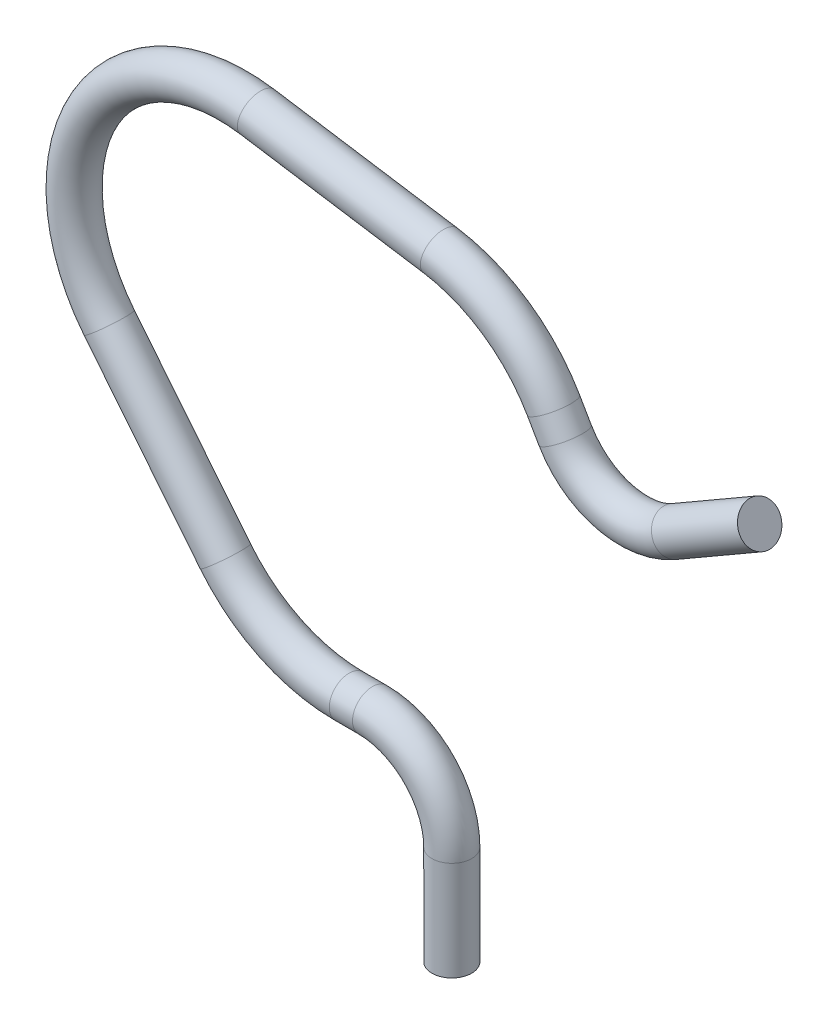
ISO-10303-21;
HEADER;
FILE_DESCRIPTION(('STEP AP214'),'2;1');
FILE_NAME('part.step','',(''),(''),'','','');
FILE_SCHEMA(('AUTOMOTIVE_DESIGN { 1 0 10303 214 1 1 1 1 }'));
ENDSEC;
DATA;
#1=APPLICATION_CONTEXT('core data for automotive mechanical design processes');
#2=APPLICATION_PROTOCOL_DEFINITION('international standard','automotive_design',2000,#1);
#3=PRODUCT_CONTEXT('',#1,'mechanical');
#4=PRODUCT('Part','Part','',(#3));
#5=PRODUCT_RELATED_PRODUCT_CATEGORY('part','',(#4));
#6=PRODUCT_DEFINITION_FORMATION('','',#4);
#7=PRODUCT_DEFINITION_CONTEXT('part definition',#1,'design');
#8=PRODUCT_DEFINITION('design','',#6,#7);
#9=PRODUCT_DEFINITION_SHAPE('','',#8);
#10=(LENGTH_UNIT() NAMED_UNIT(*) SI_UNIT(.MILLI.,.METRE.));
#11=(NAMED_UNIT(*) PLANE_ANGLE_UNIT() SI_UNIT($,.RADIAN.));
#12=(NAMED_UNIT(*) SI_UNIT($,.STERADIAN.) SOLID_ANGLE_UNIT());
#13=UNCERTAINTY_MEASURE_WITH_UNIT(LENGTH_MEASURE(1.E-05),#10,'distance_accuracy_value','');
#14=(GEOMETRIC_REPRESENTATION_CONTEXT(3) GLOBAL_UNCERTAINTY_ASSIGNED_CONTEXT((#13)) GLOBAL_UNIT_ASSIGNED_CONTEXT((#10,
#11,#12)) REPRESENTATION_CONTEXT('',''));
#15=CARTESIAN_POINT('',(0.,0.,0.));
#16=DIRECTION('',(0.,0.,1.));
#17=DIRECTION('',(1.,0.,0.));
#18=AXIS2_PLACEMENT_3D('',#15,#16,#17);
#19=CARTESIAN_POINT('',(5.58493649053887,12.1733937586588,0.));
#20=DIRECTION('',(0.866025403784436,0.500000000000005,0.));
#21=DIRECTION('',(-0.500000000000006,0.866025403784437,0.));
#22=AXIS2_PLACEMENT_3D('',#19,#20,#21);
#23=CYLINDRICAL_SURFACE('',#22,0.5);
#24=CARTESIAN_POINT('',(5.58493649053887,12.1733937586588,0.));
#25=DIRECTION('',(0.866025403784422,0.500000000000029,0.));
#26=DIRECTION('',(0.,0.,1.));
#27=AXIS2_PLACEMENT_3D('',#24,#25,#26);
#28=CIRCLE('',#27,0.5);
#29=CARTESIAN_POINT('',(5.83493649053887,11.7403810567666,0.));
#30=VERTEX_POINT('',#29);
#31=EDGE_CURVE('E28',#30,#30,#28,.T.);
#32=ORIENTED_EDGE('',*,*,#31,.T.);
#33=EDGE_LOOP('',(#32));
#34=FACE_BOUND('',#33,.T.);
#35=CARTESIAN_POINT('',(7.74999999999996,13.4233937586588,0.));
#36=DIRECTION('',(0.866025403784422,0.500000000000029,0.));
#37=DIRECTION('',(0.,0.,1.));
#38=AXIS2_PLACEMENT_3D('',#35,#36,#37);
#39=CIRCLE('',#38,0.5);
#40=CARTESIAN_POINT('',(7.74999999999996,13.4233937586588,0.500000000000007));
#41=VERTEX_POINT('',#40);
#42=EDGE_CURVE('E10',#41,#41,#39,.T.);
#43=ORIENTED_EDGE('',*,*,#42,.F.);
#44=EDGE_LOOP('',(#43));
#45=FACE_BOUND('',#44,.T.);
#46=ADVANCED_FACE('F22',(#34,#45),#23,.T.);
#47=CARTESIAN_POINT('',(4.58493649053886,13.9054445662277,0.));
#48=DIRECTION('',(0.,0.,1.));
#49=DIRECTION('',(1.,0.,0.));
#50=AXIS2_PLACEMENT_3D('',#47,#48,#49);
#51=TOROIDAL_SURFACE('',#50,2.,0.5);
#52=CARTESIAN_POINT('',(2.85288568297,12.9054445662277,0.));
#53=DIRECTION('',(0.50000000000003,-0.866025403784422,0.));
#54=DIRECTION('',(0.,0.,1.));
#55=AXIS2_PLACEMENT_3D('',#52,#53,#54);
#56=CIRCLE('',#55,0.5);
#57=CARTESIAN_POINT('',(2.41987298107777,12.6554445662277,0.));
#58=VERTEX_POINT('',#57);
#59=EDGE_CURVE('E32',#58,#58,#56,.T.);
#60=CARTESIAN_POINT('',(4.58493649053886,13.9054445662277,0.));
#61=DIRECTION('',(0.,0.,1.));
#62=DIRECTION('',(1.,0.,0.));
#63=AXIS2_PLACEMENT_3D('',#60,#61,#62);
#64=CIRCLE('',#63,2.5);
#65=EDGE_CURVE('',#58,#30,#64,.T.);
#66=ORIENTED_EDGE('',*,*,#59,.T.);
#67=ORIENTED_EDGE('',*,*,#31,.F.);
#68=ORIENTED_EDGE('',*,*,#65,.T.);
#69=ORIENTED_EDGE('',*,*,#65,.F.);
#70=EDGE_LOOP('',(#66,#68,#67,#69));
#71=FACE_BOUND('',#70,.T.);
#72=ADVANCED_FACE('F77',(#71),#51,.T.);
#73=CARTESIAN_POINT('',(2.56005317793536,13.4126453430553,0.));
#74=DIRECTION('',(0.500000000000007,-0.866025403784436,0.));
#75=DIRECTION('',(0.866025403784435,0.500000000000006,0.));
#76=AXIS2_PLACEMENT_3D('',#73,#74,#75);
#77=CYLINDRICAL_SURFACE('',#76,0.5);
#78=CARTESIAN_POINT('',(2.56005317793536,13.4126453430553,0.));
#79=DIRECTION('',(0.50000000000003,-0.866025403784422,0.));
#80=DIRECTION('',(0.,0.,1.));
#81=AXIS2_PLACEMENT_3D('',#78,#79,#80);
#82=CIRCLE('',#81,0.5);
#83=CARTESIAN_POINT('',(2.99306587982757,13.6626453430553,0.));
#84=VERTEX_POINT('',#83);
#85=EDGE_CURVE('E36',#84,#84,#82,.T.);
#86=ORIENTED_EDGE('',*,*,#85,.T.);
#87=EDGE_LOOP('',(#86));
#88=FACE_BOUND('',#87,.T.);
#89=ORIENTED_EDGE('',*,*,#59,.F.);
#90=EDGE_LOOP('',(#89));
#91=FACE_BOUND('',#90,.T.);
#92=ADVANCED_FACE('F81',(#88,#91),#77,.T.);
#93=CARTESIAN_POINT('',(-0.90404843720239,11.4126453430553,0.));
#94=DIRECTION('',(0.,0.,-1.));
#95=DIRECTION('',(-1.,0.,0.));
#96=AXIS2_PLACEMENT_3D('',#93,#94,#95);
#97=TOROIDAL_SURFACE('',#96,4.,0.5);
#98=CARTESIAN_POINT('',(-0.288658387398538,15.3650237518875,0.));
#99=DIRECTION('',(0.988094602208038,-0.153847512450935,0.));
#100=DIRECTION('',(0.,0.,1.));
#101=AXIS2_PLACEMENT_3D('',#98,#99,#100);
#102=CIRCLE('',#101,0.5);
#103=CARTESIAN_POINT('',(-0.211734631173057,15.8590710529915,0.));
#104=VERTEX_POINT('',#103);
#105=EDGE_CURVE('E41',#104,#104,#102,.T.);
#106=CARTESIAN_POINT('',(-0.90404843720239,11.4126453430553,0.));
#107=DIRECTION('',(0.,0.,-1.));
#108=DIRECTION('',(-1.,0.,0.));
#109=AXIS2_PLACEMENT_3D('',#106,#107,#108);
#110=CIRCLE('',#109,4.5);
#111=EDGE_CURVE('',#104,#84,#110,.T.);
#112=ORIENTED_EDGE('',*,*,#105,.T.);
#113=ORIENTED_EDGE('',*,*,#85,.F.);
#114=ORIENTED_EDGE('',*,*,#111,.T.);
#115=ORIENTED_EDGE('',*,*,#111,.F.);
#116=EDGE_LOOP('',(#112,#114,#113,#115));
#117=FACE_BOUND('',#116,.T.);
#118=ADVANCED_FACE('F87',(#117),#97,.T.);
#119=CARTESIAN_POINT('',(-4.89382341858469,16.0820534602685,0.));
#120=DIRECTION('',(0.988094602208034,-0.153847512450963,0.));
#121=DIRECTION('',(0.153847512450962,0.988094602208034,0.));
#122=AXIS2_PLACEMENT_3D('',#119,#120,#121);
#123=CYLINDRICAL_SURFACE('',#122,0.5);
#124=CARTESIAN_POINT('',(-4.89382341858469,16.0820534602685,0.));
#125=DIRECTION('',(0.988094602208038,-0.153847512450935,0.));
#126=DIRECTION('',(0.,0.,1.));
#127=AXIS2_PLACEMENT_3D('',#124,#125,#126);
#128=CIRCLE('',#127,0.5);
#129=CARTESIAN_POINT('',(-4.81689966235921,16.5761007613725,0.));
#130=VERTEX_POINT('',#129);
#131=EDGE_CURVE('E44',#130,#130,#128,.T.);
#132=ORIENTED_EDGE('',*,*,#131,.T.);
#133=EDGE_LOOP('',(#132));
#134=FACE_BOUND('',#133,.T.);
#135=ORIENTED_EDGE('',*,*,#105,.F.);
#136=EDGE_LOOP('',(#135));
#137=FACE_BOUND('',#136,.T.);
#138=ADVANCED_FACE('F94',(#134,#137),#123,.T.);
#139=CARTESIAN_POINT('',(-5.50921346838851,12.1296750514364,0.));
#140=DIRECTION('',(0.,0.,-1.));
#141=DIRECTION('',(-1.,0.,0.));
#142=AXIS2_PLACEMENT_3D('',#139,#140,#141);
#143=TOROIDAL_SURFACE('',#142,4.00000000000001,0.5);
#144=CARTESIAN_POINT('',(-8.62437855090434,9.62054243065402,0.));
#145=DIRECTION('',(-0.627283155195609,0.778791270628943,0.));
#146=DIRECTION('',(0.,0.,1.));
#147=AXIS2_PLACEMENT_3D('',#144,#145,#146);
#148=CIRCLE('',#147,0.5);
#149=CARTESIAN_POINT('',(-9.01377418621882,9.30690085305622,0.));
#150=VERTEX_POINT('',#149);
#151=EDGE_CURVE('E47',#150,#150,#148,.T.);
#152=CARTESIAN_POINT('',(-5.50921346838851,12.1296750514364,0.));
#153=DIRECTION('',(0.,0.,-1.));
#154=DIRECTION('',(-1.,0.,0.));
#155=AXIS2_PLACEMENT_3D('',#152,#153,#154);
#156=CIRCLE('',#155,4.50000000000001);
#157=EDGE_CURVE('',#150,#130,#156,.T.);
#158=ORIENTED_EDGE('',*,*,#151,.T.);
#159=ORIENTED_EDGE('',*,*,#131,.F.);
#160=ORIENTED_EDGE('',*,*,#157,.T.);
#161=ORIENTED_EDGE('',*,*,#157,.F.);
#162=EDGE_LOOP('',(#158,#160,#159,#161));
#163=FACE_BOUND('',#162,.T.);
#164=ADVANCED_FACE('F98',(#163),#143,.T.);
#165=CARTESIAN_POINT('',(-5.70083009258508,5.99086737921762,0.));
#166=DIRECTION('',(-0.627283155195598,0.778791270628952,0.));
#167=DIRECTION('',(-0.778791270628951,-0.627283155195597,0.));
#168=AXIS2_PLACEMENT_3D('',#165,#166,#167);
#169=CYLINDRICAL_SURFACE('',#168,0.5);
#170=CARTESIAN_POINT('',(-5.70083009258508,5.99086737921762,0.));
#171=DIRECTION('',(-0.627283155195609,0.778791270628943,0.));
#172=DIRECTION('',(0.,0.,1.));
#173=AXIS2_PLACEMENT_3D('',#170,#171,#172);
#174=CIRCLE('',#173,0.5);
#175=CARTESIAN_POINT('',(-6.09022572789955,5.67722580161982,0.));
#176=VERTEX_POINT('',#175);
#177=EDGE_CURVE('E50',#176,#176,#174,.T.);
#178=ORIENTED_EDGE('',*,*,#177,.T.);
#179=EDGE_LOOP('',(#178));
#180=FACE_BOUND('',#179,.T.);
#181=ORIENTED_EDGE('',*,*,#151,.F.);
#182=EDGE_LOOP('',(#181));
#183=FACE_BOUND('',#182,.T.);
#184=ADVANCED_FACE('F102',(#180,#183),#169,.T.);
#185=CARTESIAN_POINT('',(-2.58566501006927,8.50000000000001,0.));
#186=DIRECTION('',(0.,0.,-1.));
#187=DIRECTION('',(-1.,0.,0.));
#188=AXIS2_PLACEMENT_3D('',#185,#186,#187);
#189=TOROIDAL_SURFACE('',#188,4.,0.5);
#190=CARTESIAN_POINT('',(-2.58566501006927,4.50000000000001,0.));
#191=DIRECTION('',(-1.,0.,0.));
#192=DIRECTION('',(0.,0.,1.));
#193=AXIS2_PLACEMENT_3D('',#190,#191,#192);
#194=CIRCLE('',#193,0.5);
#195=CARTESIAN_POINT('',(-2.58566501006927,4.00000000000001,0.));
#196=VERTEX_POINT('',#195);
#197=EDGE_CURVE('E53',#196,#196,#194,.T.);
#198=CARTESIAN_POINT('',(-2.58566501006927,8.50000000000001,0.));
#199=DIRECTION('',(0.,0.,-1.));
#200=DIRECTION('',(-1.,0.,0.));
#201=AXIS2_PLACEMENT_3D('',#198,#199,#200);
#202=CIRCLE('',#201,4.5);
#203=EDGE_CURVE('',#196,#176,#202,.T.);
#204=ORIENTED_EDGE('',*,*,#197,.T.);
#205=ORIENTED_EDGE('',*,*,#177,.F.);
#206=ORIENTED_EDGE('',*,*,#203,.T.);
#207=ORIENTED_EDGE('',*,*,#203,.F.);
#208=EDGE_LOOP('',(#204,#206,#205,#207));
#209=FACE_BOUND('',#208,.T.);
#210=ADVANCED_FACE('F106',(#209),#189,.T.);
#211=CARTESIAN_POINT('',(-2.00000000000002,4.5,0.));
#212=DIRECTION('',(-1.,0.,0.));
#213=DIRECTION('',(0.,0.,1.));
#214=AXIS2_PLACEMENT_3D('',#211,#212,#213);
#215=CYLINDRICAL_SURFACE('',#214,0.5);
#216=CARTESIAN_POINT('',(-2.00000000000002,4.5,0.));
#217=DIRECTION('',(-1.,0.,0.));
#218=DIRECTION('',(0.,0.,1.));
#219=AXIS2_PLACEMENT_3D('',#216,#217,#218);
#220=CIRCLE('',#219,0.5);
#221=CARTESIAN_POINT('',(-2.00000000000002,5.,0.));
#222=VERTEX_POINT('',#221);
#223=EDGE_CURVE('E56',#222,#222,#220,.T.);
#224=ORIENTED_EDGE('',*,*,#223,.T.);
#225=EDGE_LOOP('',(#224));
#226=FACE_BOUND('',#225,.T.);
#227=ORIENTED_EDGE('',*,*,#197,.F.);
#228=EDGE_LOOP('',(#227));
#229=FACE_BOUND('',#228,.T.);
#230=ADVANCED_FACE('F110',(#226,#229),#215,.T.);
#231=CARTESIAN_POINT('',(-2.,2.5,0.));
#232=DIRECTION('',(0.,0.,1.));
#233=DIRECTION('',(1.,0.,0.));
#234=AXIS2_PLACEMENT_3D('',#231,#232,#233);
#235=TOROIDAL_SURFACE('',#234,2.,0.5);
#236=CARTESIAN_POINT('',(0.,2.49999999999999,0.));
#237=DIRECTION('',(0.,1.,0.));
#238=DIRECTION('',(0.,0.,1.));
#239=AXIS2_PLACEMENT_3D('',#236,#237,#238);
#240=CIRCLE('',#239,0.5);
#241=CARTESIAN_POINT('',(0.500000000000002,2.49999999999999,0.));
#242=VERTEX_POINT('',#241);
#243=EDGE_CURVE('E59',#242,#242,#240,.T.);
#244=CARTESIAN_POINT('',(-2.,2.5,0.));
#245=DIRECTION('',(0.,0.,1.));
#246=DIRECTION('',(1.,0.,0.));
#247=AXIS2_PLACEMENT_3D('',#244,#245,#246);
#248=CIRCLE('',#247,2.5);
#249=EDGE_CURVE('',#242,#222,#248,.T.);
#250=ORIENTED_EDGE('',*,*,#243,.T.);
#251=ORIENTED_EDGE('',*,*,#223,.F.);
#252=ORIENTED_EDGE('',*,*,#249,.T.);
#253=ORIENTED_EDGE('',*,*,#249,.F.);
#254=EDGE_LOOP('',(#250,#252,#251,#253));
#255=FACE_BOUND('',#254,.T.);
#256=ADVANCED_FACE('F114',(#255),#235,.T.);
#257=CARTESIAN_POINT('',(0.,2.49999999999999,0.));
#258=DIRECTION('',(0.,-1.,0.));
#259=DIRECTION('',(0.,0.,-1.));
#260=AXIS2_PLACEMENT_3D('',#257,#258,#259);
#261=CYLINDRICAL_SURFACE('',#260,0.5);
#262=ORIENTED_EDGE('',*,*,#243,.F.);
#263=EDGE_LOOP('',(#262));
#264=FACE_BOUND('',#263,.T.);
#265=CARTESIAN_POINT('',(0.,0.,0.));
#266=DIRECTION('',(0.,1.,0.));
#267=DIRECTION('',(0.,0.,1.));
#268=AXIS2_PLACEMENT_3D('',#265,#266,#267);
#269=CIRCLE('',#268,0.5);
#270=CARTESIAN_POINT('',(0.,0.,0.5));
#271=VERTEX_POINT('',#270);
#272=EDGE_CURVE('E62',#271,#271,#269,.T.);
#273=ORIENTED_EDGE('',*,*,#272,.T.);
#274=EDGE_LOOP('',(#273));
#275=FACE_BOUND('',#274,.T.);
#276=ADVANCED_FACE('F66',(#264,#275),#261,.T.);
#277=CARTESIAN_POINT('',(7.74999999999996,13.4233937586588,0.));
#278=DIRECTION('',(0.866025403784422,0.500000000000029,0.));
#279=DIRECTION('',(0.,0.,1.));
#280=AXIS2_PLACEMENT_3D('',#277,#278,#279);
#281=PLANE('',#280);
#282=ORIENTED_EDGE('',*,*,#42,.T.);
#283=EDGE_LOOP('',(#282));
#284=FACE_BOUND('',#283,.T.);
#285=ADVANCED_FACE('F70',(#284),#281,.T.);
#286=CARTESIAN_POINT('',(0.,0.,0.));
#287=DIRECTION('',(0.,1.,0.));
#288=DIRECTION('',(0.,0.,1.));
#289=AXIS2_PLACEMENT_3D('',#286,#287,#288);
#290=PLANE('',#289);
#291=ORIENTED_EDGE('',*,*,#272,.F.);
#292=EDGE_LOOP('',(#291));
#293=FACE_BOUND('',#292,.T.);
#294=ADVANCED_FACE('F68',(#293),#290,.F.);
#295=CLOSED_SHELL('',(#46,#72,#92,#118,#138,#164,#184,#210,#230,#256,#276,#285,#294));
#296=MANIFOLD_SOLID_BREP('B2',#295);
#297=ADVANCED_BREP_SHAPE_REPRESENTATION('',(#18,#296),#14);
#298=SHAPE_DEFINITION_REPRESENTATION(#9,#297);
ENDSEC;
END-ISO-10303-21;
